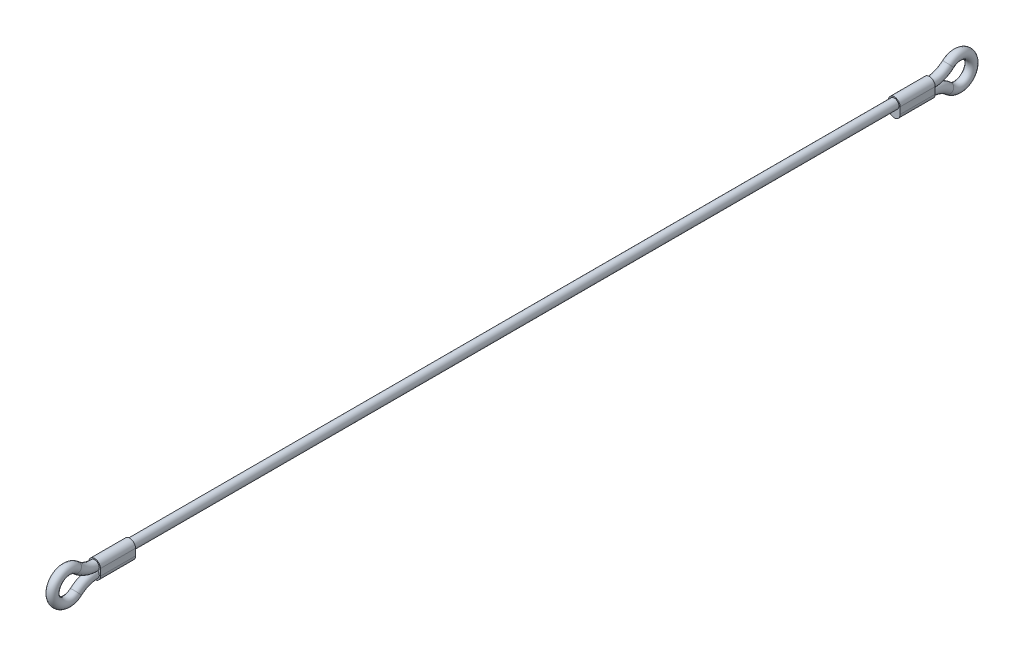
ISO-10303-21;
HEADER;
FILE_DESCRIPTION(('STEP AP214'),'2;1');
FILE_NAME('part.step','',(''),(''),'','','');
FILE_SCHEMA(('AUTOMOTIVE_DESIGN { 1 0 10303 214 1 1 1 1 }'));
ENDSEC;
DATA;
#1=APPLICATION_CONTEXT('core data for automotive mechanical design processes');
#2=APPLICATION_PROTOCOL_DEFINITION('international standard','automotive_design',2000,#1);
#3=PRODUCT_CONTEXT('',#1,'mechanical');
#4=PRODUCT('Part','Part','',(#3));
#5=PRODUCT_RELATED_PRODUCT_CATEGORY('part','',(#4));
#6=PRODUCT_DEFINITION_FORMATION('','',#4);
#7=PRODUCT_DEFINITION_CONTEXT('part definition',#1,'design');
#8=PRODUCT_DEFINITION('design','',#6,#7);
#9=PRODUCT_DEFINITION_SHAPE('','',#8);
#10=(LENGTH_UNIT() NAMED_UNIT(*) SI_UNIT(.MILLI.,.METRE.));
#11=(NAMED_UNIT(*) PLANE_ANGLE_UNIT() SI_UNIT($,.RADIAN.));
#12=(NAMED_UNIT(*) SI_UNIT($,.STERADIAN.) SOLID_ANGLE_UNIT());
#13=UNCERTAINTY_MEASURE_WITH_UNIT(LENGTH_MEASURE(1.E-05),#10,'distance_accuracy_value','');
#14=(GEOMETRIC_REPRESENTATION_CONTEXT(3) GLOBAL_UNCERTAINTY_ASSIGNED_CONTEXT((#13)) GLOBAL_UNIT_ASSIGNED_CONTEXT((#10,
#11,#12)) REPRESENTATION_CONTEXT('',''));
#15=CARTESIAN_POINT('',(0.,0.,0.));
#16=DIRECTION('',(0.,0.,1.));
#17=DIRECTION('',(1.,0.,0.));
#18=AXIS2_PLACEMENT_3D('',#15,#16,#17);
#19=CARTESIAN_POINT('',(0.,0.,-142.8));
#20=DIRECTION('',(0.,0.,1.));
#21=DIRECTION('',(1.,0.,0.));
#22=AXIS2_PLACEMENT_3D('',#19,#20,#21);
#23=CYLINDRICAL_SURFACE('',#22,1.59);
#24=CARTESIAN_POINT('',(0.,0.,-130.8));
#25=DIRECTION('',(0.,0.,1.));
#26=DIRECTION('',(0.,-1.,0.));
#27=AXIS2_PLACEMENT_3D('',#24,#25,#26);
#28=CIRCLE('',#27,1.59);
#29=CARTESIAN_POINT('',(0.,-1.59,-130.8));
#30=VERTEX_POINT('',#29);
#31=EDGE_CURVE('E11',#30,#30,#28,.F.);
#32=ORIENTED_EDGE('',*,*,#31,.F.);
#33=EDGE_LOOP('',(#32));
#34=FACE_BOUND('',#33,.T.);
#35=CARTESIAN_POINT('',(0.,0.,130.8));
#36=DIRECTION('',(0.,0.,-1.));
#37=DIRECTION('',(0.,1.,0.));
#38=AXIS2_PLACEMENT_3D('',#35,#36,#37);
#39=CIRCLE('',#38,1.59);
#40=CARTESIAN_POINT('',(0.,1.59,130.8));
#41=VERTEX_POINT('',#40);
#42=EDGE_CURVE('E44',#41,#41,#39,.F.);
#43=ORIENTED_EDGE('',*,*,#42,.F.);
#44=EDGE_LOOP('',(#43));
#45=FACE_BOUND('',#44,.T.);
#46=ADVANCED_FACE('F35',(#34,#45),#23,.T.);
#47=CARTESIAN_POINT('',(0.,0.,130.8));
#48=DIRECTION('',(0.,0.,1.));
#49=DIRECTION('',(0.,-1.,0.));
#50=AXIS2_PLACEMENT_3D('',#47,#48,#49);
#51=CYLINDRICAL_SURFACE('',#50,1.995);
#52=CARTESIAN_POINT('',(0.,0.,142.8));
#53=DIRECTION('',(0.,0.,-1.));
#54=DIRECTION('',(0.,1.,0.));
#55=AXIS2_PLACEMENT_3D('',#52,#53,#54);
#56=CIRCLE('',#55,1.995);
#57=CARTESIAN_POINT('',(-1.995,0.,142.8));
#58=VERTEX_POINT('',#57);
#59=CARTESIAN_POINT('',(1.995,0.,142.8));
#60=VERTEX_POINT('',#59);
#61=EDGE_CURVE('E126',#58,#60,#56,.T.);
#62=ORIENTED_EDGE('',*,*,#61,.T.);
#63=DIRECTION('',(0.,0.,1.));
#64=VECTOR('',#63,1.);
#65=CARTESIAN_POINT('',(1.995,0.,130.8));
#66=LINE('',#65,#64);
#67=CARTESIAN_POINT('',(1.995,0.,130.8));
#68=VERTEX_POINT('',#67);
#69=EDGE_CURVE('E184',#68,#60,#66,.T.);
#70=ORIENTED_EDGE('',*,*,#69,.F.);
#71=CARTESIAN_POINT('',(0.,0.,130.8));
#72=DIRECTION('',(0.,0.,-1.));
#73=DIRECTION('',(0.,1.,0.));
#74=AXIS2_PLACEMENT_3D('',#71,#72,#73);
#75=CIRCLE('',#74,1.995);
#76=CARTESIAN_POINT('',(-1.995,0.,130.8));
#77=VERTEX_POINT('',#76);
#78=EDGE_CURVE('E158',#77,#68,#75,.T.);
#79=ORIENTED_EDGE('',*,*,#78,.F.);
#80=DIRECTION('',(0.,0.,1.));
#81=VECTOR('',#80,1.);
#82=CARTESIAN_POINT('',(-1.995,0.,130.8));
#83=LINE('',#82,#81);
#84=EDGE_CURVE('E168',#77,#58,#83,.T.);
#85=ORIENTED_EDGE('',*,*,#84,.T.);
#86=EDGE_LOOP('',(#62,#70,#79,#85));
#87=FACE_BOUND('',#86,.T.);
#88=ADVANCED_FACE('F238',(#87),#51,.T.);
#89=CARTESIAN_POINT('',(1.995,0.,130.8));
#90=DIRECTION('',(-1.,0.,0.));
#91=DIRECTION('',(0.,0.,1.));
#92=AXIS2_PLACEMENT_3D('',#89,#90,#91);
#93=PLANE('',#92);
#94=DIRECTION('',(0.,-1.,0.));
#95=VECTOR('',#94,1.);
#96=CARTESIAN_POINT('',(1.995,0.,142.8));
#97=LINE('',#96,#95);
#98=CARTESIAN_POINT('',(1.995,-2.26625258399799,142.8));
#99=VERTEX_POINT('',#98);
#100=EDGE_CURVE('E171',#60,#99,#97,.T.);
#101=ORIENTED_EDGE('',*,*,#100,.T.);
#102=DIRECTION('',(0.,0.,1.));
#103=VECTOR('',#102,1.);
#104=CARTESIAN_POINT('',(1.995,-2.266252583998,130.8));
#105=LINE('',#104,#103);
#106=CARTESIAN_POINT('',(1.995,-2.266252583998,130.8));
#107=VERTEX_POINT('',#106);
#108=EDGE_CURVE('E181',#107,#99,#105,.T.);
#109=ORIENTED_EDGE('',*,*,#108,.F.);
#110=DIRECTION('',(0.,-1.,0.));
#111=VECTOR('',#110,1.);
#112=CARTESIAN_POINT('',(1.995,0.,130.8));
#113=LINE('',#112,#111);
#114=EDGE_CURVE('E161',#68,#107,#113,.T.);
#115=ORIENTED_EDGE('',*,*,#114,.F.);
#116=ORIENTED_EDGE('',*,*,#69,.T.);
#117=EDGE_LOOP('',(#101,#109,#115,#116));
#118=FACE_BOUND('',#117,.T.);
#119=ADVANCED_FACE('F243',(#118),#93,.F.);
#120=CARTESIAN_POINT('',(0.,-2.266252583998,130.8));
#121=DIRECTION('',(0.,0.,1.));
#122=DIRECTION('',(0.,-1.,0.));
#123=AXIS2_PLACEMENT_3D('',#120,#121,#122);
#124=CYLINDRICAL_SURFACE('',#123,1.995);
#125=CARTESIAN_POINT('',(0.,-2.26625258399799,142.8));
#126=DIRECTION('',(0.,0.,-1.));
#127=DIRECTION('',(0.,1.,0.));
#128=AXIS2_PLACEMENT_3D('',#125,#126,#127);
#129=CIRCLE('',#128,1.995);
#130=CARTESIAN_POINT('',(-1.995,-2.26625258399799,142.8));
#131=VERTEX_POINT('',#130);
#132=EDGE_CURVE('E173',#99,#131,#129,.T.);
#133=ORIENTED_EDGE('',*,*,#132,.T.);
#134=DIRECTION('',(0.,0.,1.));
#135=VECTOR('',#134,1.);
#136=CARTESIAN_POINT('',(-1.995,-2.266252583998,130.8));
#137=LINE('',#136,#135);
#138=CARTESIAN_POINT('',(-1.995,-2.266252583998,130.8));
#139=VERTEX_POINT('',#138);
#140=EDGE_CURVE('E178',#139,#131,#137,.T.);
#141=ORIENTED_EDGE('',*,*,#140,.F.);
#142=CARTESIAN_POINT('',(0.,-2.266252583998,130.8));
#143=DIRECTION('',(0.,0.,-1.));
#144=DIRECTION('',(0.,1.,0.));
#145=AXIS2_PLACEMENT_3D('',#142,#143,#144);
#146=CIRCLE('',#145,1.995);
#147=EDGE_CURVE('E164',#107,#139,#146,.T.);
#148=ORIENTED_EDGE('',*,*,#147,.F.);
#149=ORIENTED_EDGE('',*,*,#108,.T.);
#150=EDGE_LOOP('',(#133,#141,#148,#149));
#151=FACE_BOUND('',#150,.T.);
#152=ADVANCED_FACE('F282',(#151),#124,.T.);
#153=CARTESIAN_POINT('',(-1.995,0.,130.8));
#154=DIRECTION('',(1.,0.,0.));
#155=DIRECTION('',(0.,1.,0.));
#156=AXIS2_PLACEMENT_3D('',#153,#154,#155);
#157=PLANE('',#156);
#158=DIRECTION('',(0.,1.,0.));
#159=VECTOR('',#158,1.);
#160=CARTESIAN_POINT('',(-1.995,0.,142.8));
#161=LINE('',#160,#159);
#162=EDGE_CURVE('E162',#131,#58,#161,.T.);
#163=ORIENTED_EDGE('',*,*,#162,.T.);
#164=ORIENTED_EDGE('',*,*,#84,.F.);
#165=DIRECTION('',(0.,1.,0.));
#166=VECTOR('',#165,1.);
#167=CARTESIAN_POINT('',(-1.995,0.,130.8));
#168=LINE('',#167,#166);
#169=EDGE_CURVE('E166',#139,#77,#168,.T.);
#170=ORIENTED_EDGE('',*,*,#169,.F.);
#171=ORIENTED_EDGE('',*,*,#140,.T.);
#172=EDGE_LOOP('',(#163,#164,#170,#171));
#173=FACE_BOUND('',#172,.T.);
#174=ADVANCED_FACE('F278',(#173),#157,.F.);
#175=CARTESIAN_POINT('',(0.,0.,130.8));
#176=DIRECTION('',(0.,0.,-1.));
#177=DIRECTION('',(0.,1.,0.));
#178=AXIS2_PLACEMENT_3D('',#175,#176,#177);
#179=PLANE('',#178);
#180=ORIENTED_EDGE('',*,*,#42,.T.);
#181=EDGE_LOOP('',(#180));
#182=FACE_BOUND('',#181,.T.);
#183=ORIENTED_EDGE('',*,*,#78,.T.);
#184=ORIENTED_EDGE('',*,*,#114,.T.);
#185=ORIENTED_EDGE('',*,*,#147,.T.);
#186=ORIENTED_EDGE('',*,*,#169,.T.);
#187=EDGE_LOOP('',(#183,#184,#185,#186));
#188=FACE_BOUND('',#187,.T.);
#189=ADVANCED_FACE('F232',(#182,#188),#179,.T.);
#190=CARTESIAN_POINT('',(0.,0.,142.8));
#191=DIRECTION('',(0.,0.,-1.));
#192=DIRECTION('',(0.,1.,0.));
#193=AXIS2_PLACEMENT_3D('',#190,#191,#192);
#194=PLANE('',#193);
#195=CARTESIAN_POINT('',(0.,0.,142.8));
#196=DIRECTION('',(0.,0.,1.));
#197=DIRECTION('',(1.,0.,0.));
#198=AXIS2_PLACEMENT_3D('',#195,#196,#197);
#199=CIRCLE('',#198,1.59);
#200=CARTESIAN_POINT('',(1.11540342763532,-1.13312629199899,142.8));
#201=VERTEX_POINT('',#200);
#202=CARTESIAN_POINT('',(-1.11540342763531,-1.13312629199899,142.8));
#203=VERTEX_POINT('',#202);
#204=EDGE_CURVE('E196',#201,#203,#199,.T.);
#205=ORIENTED_EDGE('',*,*,#204,.F.);
#206=CARTESIAN_POINT('',(0.,-2.26625258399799,142.8));
#207=DIRECTION('',(0.,0.,-1.));
#208=DIRECTION('',(1.,0.,0.));
#209=AXIS2_PLACEMENT_3D('',#206,#207,#208);
#210=CIRCLE('',#209,1.59);
#211=EDGE_CURVE('E57',#201,#203,#210,.T.);
#212=ORIENTED_EDGE('',*,*,#211,.T.);
#213=EDGE_LOOP('',(#205,#212));
#214=FACE_BOUND('',#213,.T.);
#215=ORIENTED_EDGE('',*,*,#61,.F.);
#216=ORIENTED_EDGE('',*,*,#162,.F.);
#217=ORIENTED_EDGE('',*,*,#132,.F.);
#218=ORIENTED_EDGE('',*,*,#100,.F.);
#219=EDGE_LOOP('',(#215,#216,#217,#218));
#220=FACE_BOUND('',#219,.T.);
#221=ADVANCED_FACE('F226',(#214,#220),#194,.F.);
#222=CARTESIAN_POINT('',(0.,-1.13312629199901,152.4));
#223=DIRECTION('',(1.,0.,0.));
#224=DIRECTION('',(0.,0.,-1.));
#225=AXIS2_PLACEMENT_3D('',#222,#223,#224);
#226=TOROIDAL_SURFACE('',#225,4.80000000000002,1.59);
#227=CARTESIAN_POINT('',(0.,2.4445824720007,149.2));
#228=DIRECTION('',(0.,0.666666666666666,0.745355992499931));
#229=DIRECTION('',(1.,0.,0.));
#230=AXIS2_PLACEMENT_3D('',#227,#228,#229);
#231=CIRCLE('',#230,1.59);
#232=CARTESIAN_POINT('',(0.,3.6296985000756,148.14));
#233=VERTEX_POINT('',#232);
#234=EDGE_CURVE('E198',#233,#233,#231,.T.);
#235=CARTESIAN_POINT('',(0.,-4.71083505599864,149.2));
#236=DIRECTION('',(0.,0.666666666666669,-0.745355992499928));
#237=DIRECTION('',(1.,0.,0.));
#238=AXIS2_PLACEMENT_3D('',#235,#236,#237);
#239=CIRCLE('',#238,1.59);
#240=CARTESIAN_POINT('',(0.,-5.89595108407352,148.14));
#241=VERTEX_POINT('',#240);
#242=EDGE_CURVE('E201',#241,#241,#239,.T.);
#243=CARTESIAN_POINT('',(0.,-1.13312629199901,152.4));
#244=DIRECTION('',(1.,0.,0.));
#245=DIRECTION('',(0.,0.,-1.));
#246=AXIS2_PLACEMENT_3D('',#243,#244,#245);
#247=CIRCLE('',#246,6.39000000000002);
#248=EDGE_CURVE('',#233,#241,#247,.T.);
#249=ORIENTED_EDGE('',*,*,#234,.T.);
#250=ORIENTED_EDGE('',*,*,#242,.F.);
#251=ORIENTED_EDGE('',*,*,#248,.T.);
#252=ORIENTED_EDGE('',*,*,#248,.F.);
#253=EDGE_LOOP('',(#249,#251,#250,#252));
#254=FACE_BOUND('',#253,.T.);
#255=ADVANCED_FACE('F224',(#254),#226,.T.);
#256=CARTESIAN_POINT('',(0.,-11.866252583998,142.8));
#257=DIRECTION('',(-1.,0.,0.));
#258=DIRECTION('',(0.,0.,1.));
#259=AXIS2_PLACEMENT_3D('',#256,#257,#258);
#260=TOROIDAL_SURFACE('',#259,9.59999999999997,1.59);
#261=CARTESIAN_POINT('',(-1.11540342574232,-1.13312629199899,142.7998));
#262=CARTESIAN_POINT('',(-1.11534851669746,-1.13312629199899,142.92773673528));
#263=CARTESIAN_POINT('',(-1.11308141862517,-1.13312629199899,143.055686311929));
#264=CARTESIAN_POINT('',(-1.10371453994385,-1.13312629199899,143.31155828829));
#265=CARTESIAN_POINT('',(-1.09660901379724,-1.13312629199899,143.43948047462));
#266=CARTESIAN_POINT('',(-1.07704253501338,-1.13312629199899,143.696418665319));
#267=CARTESIAN_POINT('',(-1.06452051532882,-1.13312629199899,143.825430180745));
#268=CARTESIAN_POINT('',(-1.03319430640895,-1.133126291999,144.082627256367));
#269=CARTESIAN_POINT('',(-1.01439338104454,-1.133126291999,144.210813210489));
#270=CARTESIAN_POINT('',(-0.966908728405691,-1.13312629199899,144.478005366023));
#271=CARTESIAN_POINT('',(-0.93745613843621,-1.13312629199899,144.616883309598));
#272=CARTESIAN_POINT('',(-0.883915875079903,-1.13312629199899,144.82263125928));
#273=CARTESIAN_POINT('',(-0.864530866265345,-1.133126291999,144.890724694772));
#274=CARTESIAN_POINT('',(-0.821996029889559,-1.133126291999,145.025715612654));
#275=CARTESIAN_POINT('',(-0.798847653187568,-1.133126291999,145.092613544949));
#276=CARTESIAN_POINT('',(-0.744519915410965,-1.133126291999,145.233542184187));
#277=CARTESIAN_POINT('',(-0.712679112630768,-1.133126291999,145.307321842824));
#278=CARTESIAN_POINT('',(-0.641279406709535,-1.133126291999,145.451146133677));
#279=CARTESIAN_POINT('',(-0.60172727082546,-1.133126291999,145.521193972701));
#280=CARTESIAN_POINT('',(-0.528948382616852,-1.133126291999,145.62943568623));
#281=CARTESIAN_POINT('',(-0.498892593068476,-1.133126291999,145.669741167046));
#282=CARTESIAN_POINT('',(-0.433770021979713,-1.133126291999,145.7461405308));
#283=CARTESIAN_POINT('',(-0.398710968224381,-1.133126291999,145.782240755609));
#284=CARTESIAN_POINT('',(-0.335060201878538,-1.133126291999,145.837058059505));
#285=CARTESIAN_POINT('',(-0.308066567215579,-1.133126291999,145.857612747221));
#286=CARTESIAN_POINT('',(-0.251279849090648,-1.133126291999,145.894433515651));
#287=CARTESIAN_POINT('',(-0.221491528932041,-1.133126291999,145.910706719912));
#288=CARTESIAN_POINT('',(-0.165682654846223,-1.133126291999,145.934797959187));
#289=CARTESIAN_POINT('',(-0.140117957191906,-1.133126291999,145.943660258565));
#290=CARTESIAN_POINT('',(-0.0878641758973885,-1.133126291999,145.956990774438));
#291=CARTESIAN_POINT('',(-0.0611762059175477,-1.133126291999,145.961463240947));
#292=CARTESIAN_POINT('',(-0.00731772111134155,-1.133126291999,145.965572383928));
#293=CARTESIAN_POINT('',(0.0198542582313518,-1.133126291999,145.965190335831));
#294=CARTESIAN_POINT('',(0.0736951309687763,-1.133126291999,145.959586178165));
#295=CARTESIAN_POINT('',(0.100363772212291,-1.13312629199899,145.954361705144));
#296=CARTESIAN_POINT('',(0.151195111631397,-1.133126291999,145.939957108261));
#297=CARTESIAN_POINT('',(0.175416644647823,-1.133126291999,145.930979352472));
#298=CARTESIAN_POINT('',(0.222373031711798,-1.133126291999,145.909774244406));
#299=CARTESIAN_POINT('',(0.245107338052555,-1.133126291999,145.897545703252));
#300=CARTESIAN_POINT('',(0.304759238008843,-1.133126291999,145.860748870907));
#301=CARTESIAN_POINT('',(0.340101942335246,-1.133126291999,145.833635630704));
#302=CARTESIAN_POINT('',(0.406281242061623,-1.133126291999,145.77436880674));
#303=CARTESIAN_POINT('',(0.437102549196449,-1.133126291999,145.742198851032));
#304=CARTESIAN_POINT('',(0.492718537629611,-1.133126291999,145.67701365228));
#305=CARTESIAN_POINT('',(0.517788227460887,-1.133126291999,145.644229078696));
#306=CARTESIAN_POINT('',(0.565060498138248,-1.133126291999,145.576639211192));
#307=CARTESIAN_POINT('',(0.587260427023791,-1.133126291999,145.541832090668));
#308=CARTESIAN_POINT('',(0.650275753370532,-1.13312629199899,145.435150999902));
#309=CARTESIAN_POINT('',(0.687428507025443,-1.133126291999,145.361116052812));
#310=CARTESIAN_POINT('',(0.745434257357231,-1.133126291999,145.230275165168));
#311=CARTESIAN_POINT('',(0.767985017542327,-1.13312629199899,145.174182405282));
#312=CARTESIAN_POINT('',(0.809859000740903,-1.13312629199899,145.060796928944));
#313=CARTESIAN_POINT('',(0.82918188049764,-1.133126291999,145.003504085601));
#314=CARTESIAN_POINT('',(0.883166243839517,-1.133126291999,144.830173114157));
#315=CARTESIAN_POINT('',(0.91376333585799,-1.13312629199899,144.712874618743));
#316=CARTESIAN_POINT('',(0.967023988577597,-1.13312629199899,144.475955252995));
#317=CARTESIAN_POINT('',(0.989647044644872,-1.13312629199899,144.356325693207));
#318=CARTESIAN_POINT('',(1.02845868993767,-1.13312629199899,144.116012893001));
#319=CARTESIAN_POINT('',(1.04464572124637,-1.13312629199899,143.995329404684));
#320=CARTESIAN_POINT('',(1.06818793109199,-1.13312629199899,143.78453669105));
#321=CARTESIAN_POINT('',(1.07674400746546,-1.13312629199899,143.694556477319));
#322=CARTESIAN_POINT('',(1.09119671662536,-1.13312629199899,143.514367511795));
#323=CARTESIAN_POINT('',(1.09709289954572,-1.13312629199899,143.424158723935));
#324=CARTESIAN_POINT('',(1.10635885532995,-1.13312629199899,143.244939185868));
#325=CARTESIAN_POINT('',(1.10976438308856,-1.13312629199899,143.155930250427));
#326=CARTESIAN_POINT('',(1.11428069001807,-1.13312629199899,142.977880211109));
#327=CARTESIAN_POINT('',(1.11539214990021,-1.13312629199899,142.888839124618));
#328=CARTESIAN_POINT('',(1.11540342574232,-1.13312629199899,142.7998));
#329=B_SPLINE_CURVE_WITH_KNOTS('',3,(#261,#262,#263,#264,#265,#266,#267,#268,#269,#270,#271,
#272,#273,#274,#275,#276,#277,#278,#279,#280,#281,#282,#283,#284,#285,#286,#287,#288,#289,#290,
#291,#292,#293,#294,#295,#296,#297,#298,#299,#300,#301,#302,#303,#304,#305,#306,#307,#308,#309,
#310,#311,#312,#313,#314,#315,#316,#317,#318,#319,#320,#321,#322,#323,#324,#325,#326,#327,#328),
.UNSPECIFIED.,.F.,.F.,(4,2,2,2,2,2,2,2,2,2,2,2,2,2,2,2,2,2,2,2,2,2,2,2,2,2,2,2,2,2,2,2,2,4),(0.,
0.383810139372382,0.768076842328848,1.15679365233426,1.5453087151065,1.97071269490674,
2.18302701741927,2.39525968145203,2.63604166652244,2.8766132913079,3.02716706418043,
3.17749076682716,3.27898827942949,3.38031583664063,3.46115731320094,3.5419204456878,
3.62299518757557,3.7041095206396,3.78132200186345,3.858562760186,3.99142265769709,
4.1247219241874,4.24834991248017,4.37209134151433,4.61994843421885,4.80123584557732,
4.98254252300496,5.34577733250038,5.71083149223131,6.07597396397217,6.34709439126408,
6.61826065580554,6.88545336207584,7.15256677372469),.UNSPECIFIED.);
#330=EDGE_CURVE('E205',#203,#201,#329,.T.);
#331=ORIENTED_EDGE('',*,*,#330,.F.);
#332=ORIENTED_EDGE('',*,*,#211,.F.);
#333=EDGE_LOOP('',(#331,#332));
#334=FACE_BOUND('',#333,.T.);
#335=ORIENTED_EDGE('',*,*,#242,.T.);
#336=EDGE_LOOP('',(#335));
#337=FACE_BOUND('',#336,.T.);
#338=ADVANCED_FACE('F37',(#334,#337),#260,.T.);
#339=CARTESIAN_POINT('',(0.,9.59999999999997,142.8));
#340=DIRECTION('',(-1.,0.,0.));
#341=DIRECTION('',(0.,0.,1.));
#342=AXIS2_PLACEMENT_3D('',#339,#340,#341);
#343=TOROIDAL_SURFACE('',#342,9.59999999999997,1.59);
#344=ORIENTED_EDGE('',*,*,#234,.F.);
#345=EDGE_LOOP('',(#344));
#346=FACE_BOUND('',#345,.T.);
#347=ORIENTED_EDGE('',*,*,#204,.T.);
#348=ORIENTED_EDGE('',*,*,#330,.T.);
#349=EDGE_LOOP('',(#347,#348));
#350=FACE_BOUND('',#349,.T.);
#351=ADVANCED_FACE('F219',(#346,#350),#343,.T.);
#352=CARTESIAN_POINT('',(0.,0.,-130.8));
#353=DIRECTION('',(0.,0.,-1.));
#354=DIRECTION('',(0.,1.,0.));
#355=AXIS2_PLACEMENT_3D('',#352,#353,#354);
#356=CYLINDRICAL_SURFACE('',#355,1.995);
#357=CARTESIAN_POINT('',(0.,0.,-142.8));
#358=DIRECTION('',(0.,0.,-1.));
#359=DIRECTION('',(0.,1.,0.));
#360=AXIS2_PLACEMENT_3D('',#357,#358,#359);
#361=CIRCLE('',#360,1.995);
#362=CARTESIAN_POINT('',(-1.995,0.,-142.8));
#363=VERTEX_POINT('',#362);
#364=CARTESIAN_POINT('',(1.995,0.,-142.8));
#365=VERTEX_POINT('',#364);
#366=EDGE_CURVE('E121',#363,#365,#361,.T.);
#367=ORIENTED_EDGE('',*,*,#366,.F.);
#368=DIRECTION('',(0.,0.,-1.));
#369=VECTOR('',#368,1.);
#370=CARTESIAN_POINT('',(-1.995,0.,-130.8));
#371=LINE('',#370,#369);
#372=CARTESIAN_POINT('',(-1.995,0.,-130.8));
#373=VERTEX_POINT('',#372);
#374=EDGE_CURVE('E115',#373,#363,#371,.T.);
#375=ORIENTED_EDGE('',*,*,#374,.F.);
#376=CARTESIAN_POINT('',(0.,0.,-130.8));
#377=DIRECTION('',(0.,0.,-1.));
#378=DIRECTION('',(0.,1.,0.));
#379=AXIS2_PLACEMENT_3D('',#376,#377,#378);
#380=CIRCLE('',#379,1.995);
#381=CARTESIAN_POINT('',(1.995,0.,-130.8));
#382=VERTEX_POINT('',#381);
#383=EDGE_CURVE('E118',#373,#382,#380,.T.);
#384=ORIENTED_EDGE('',*,*,#383,.T.);
#385=DIRECTION('',(0.,0.,-1.));
#386=VECTOR('',#385,1.);
#387=CARTESIAN_POINT('',(1.995,0.,-130.8));
#388=LINE('',#387,#386);
#389=EDGE_CURVE('E145',#382,#365,#388,.T.);
#390=ORIENTED_EDGE('',*,*,#389,.T.);
#391=EDGE_LOOP('',(#367,#375,#384,#390));
#392=FACE_BOUND('',#391,.T.);
#393=ADVANCED_FACE('F117',(#392),#356,.T.);
#394=CARTESIAN_POINT('',(-1.995,0.,-130.8));
#395=DIRECTION('',(-1.,0.,0.));
#396=DIRECTION('',(0.,-1.,0.));
#397=AXIS2_PLACEMENT_3D('',#394,#395,#396);
#398=PLANE('',#397);
#399=DIRECTION('',(0.,1.,0.));
#400=VECTOR('',#399,1.);
#401=CARTESIAN_POINT('',(-1.995,0.,-142.8));
#402=LINE('',#401,#400);
#403=CARTESIAN_POINT('',(-1.995,-2.26625258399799,-142.8));
#404=VERTEX_POINT('',#403);
#405=EDGE_CURVE('E147',#404,#363,#402,.T.);
#406=ORIENTED_EDGE('',*,*,#405,.F.);
#407=DIRECTION('',(0.,0.,-1.));
#408=VECTOR('',#407,1.);
#409=CARTESIAN_POINT('',(-1.995,-2.266252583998,-130.8));
#410=LINE('',#409,#408);
#411=CARTESIAN_POINT('',(-1.995,-2.266252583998,-130.8));
#412=VERTEX_POINT('',#411);
#413=EDGE_CURVE('E127',#412,#404,#410,.T.);
#414=ORIENTED_EDGE('',*,*,#413,.F.);
#415=DIRECTION('',(0.,1.,0.));
#416=VECTOR('',#415,1.);
#417=CARTESIAN_POINT('',(-1.995,0.,-130.8));
#418=LINE('',#417,#416);
#419=EDGE_CURVE('E133',#412,#373,#418,.T.);
#420=ORIENTED_EDGE('',*,*,#419,.T.);
#421=ORIENTED_EDGE('',*,*,#374,.T.);
#422=EDGE_LOOP('',(#406,#414,#420,#421));
#423=FACE_BOUND('',#422,.T.);
#424=ADVANCED_FACE('F139',(#423),#398,.T.);
#425=CARTESIAN_POINT('',(0.,-2.266252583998,-130.8));
#426=DIRECTION('',(0.,0.,-1.));
#427=DIRECTION('',(0.,1.,0.));
#428=AXIS2_PLACEMENT_3D('',#425,#426,#427);
#429=CYLINDRICAL_SURFACE('',#428,1.995);
#430=CARTESIAN_POINT('',(0.,-2.26625258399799,-142.8));
#431=DIRECTION('',(0.,0.,-1.));
#432=DIRECTION('',(0.,1.,0.));
#433=AXIS2_PLACEMENT_3D('',#430,#431,#432);
#434=CIRCLE('',#433,1.995);
#435=CARTESIAN_POINT('',(1.995,-2.26625258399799,-142.8));
#436=VERTEX_POINT('',#435);
#437=EDGE_CURVE('E149',#436,#404,#434,.T.);
#438=ORIENTED_EDGE('',*,*,#437,.F.);
#439=DIRECTION('',(0.,0.,-1.));
#440=VECTOR('',#439,1.);
#441=CARTESIAN_POINT('',(1.995,-2.266252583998,-130.8));
#442=LINE('',#441,#440);
#443=CARTESIAN_POINT('',(1.995,-2.266252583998,-130.8));
#444=VERTEX_POINT('',#443);
#445=EDGE_CURVE('E155',#444,#436,#442,.T.);
#446=ORIENTED_EDGE('',*,*,#445,.F.);
#447=CARTESIAN_POINT('',(0.,-2.266252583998,-130.8));
#448=DIRECTION('',(0.,0.,-1.));
#449=DIRECTION('',(0.,1.,0.));
#450=AXIS2_PLACEMENT_3D('',#447,#448,#449);
#451=CIRCLE('',#450,1.995);
#452=EDGE_CURVE('E140',#444,#412,#451,.T.);
#453=ORIENTED_EDGE('',*,*,#452,.T.);
#454=ORIENTED_EDGE('',*,*,#413,.T.);
#455=EDGE_LOOP('',(#438,#446,#453,#454));
#456=FACE_BOUND('',#455,.T.);
#457=ADVANCED_FACE('F265',(#456),#429,.T.);
#458=CARTESIAN_POINT('',(1.995,0.,-130.8));
#459=DIRECTION('',(1.,0.,0.));
#460=DIRECTION('',(0.,0.,-1.));
#461=AXIS2_PLACEMENT_3D('',#458,#459,#460);
#462=PLANE('',#461);
#463=DIRECTION('',(0.,-1.,0.));
#464=VECTOR('',#463,1.);
#465=CARTESIAN_POINT('',(1.995,0.,-142.8));
#466=LINE('',#465,#464);
#467=EDGE_CURVE('E137',#365,#436,#466,.T.);
#468=ORIENTED_EDGE('',*,*,#467,.F.);
#469=ORIENTED_EDGE('',*,*,#389,.F.);
#470=DIRECTION('',(0.,-1.,0.));
#471=VECTOR('',#470,1.);
#472=CARTESIAN_POINT('',(1.995,0.,-130.8));
#473=LINE('',#472,#471);
#474=EDGE_CURVE('E136',#382,#444,#473,.T.);
#475=ORIENTED_EDGE('',*,*,#474,.T.);
#476=ORIENTED_EDGE('',*,*,#445,.T.);
#477=EDGE_LOOP('',(#468,#469,#475,#476));
#478=FACE_BOUND('',#477,.T.);
#479=ADVANCED_FACE('F262',(#478),#462,.T.);
#480=CARTESIAN_POINT('',(0.,0.,-130.8));
#481=DIRECTION('',(0.,0.,1.));
#482=DIRECTION('',(0.,1.,0.));
#483=AXIS2_PLACEMENT_3D('',#480,#481,#482);
#484=PLANE('',#483);
#485=ORIENTED_EDGE('',*,*,#31,.T.);
#486=EDGE_LOOP('',(#485));
#487=FACE_BOUND('',#486,.T.);
#488=ORIENTED_EDGE('',*,*,#383,.F.);
#489=ORIENTED_EDGE('',*,*,#419,.F.);
#490=ORIENTED_EDGE('',*,*,#452,.F.);
#491=ORIENTED_EDGE('',*,*,#474,.F.);
#492=EDGE_LOOP('',(#488,#489,#490,#491));
#493=FACE_BOUND('',#492,.T.);
#494=ADVANCED_FACE('F131',(#487,#493),#484,.T.);
#495=CARTESIAN_POINT('',(0.,0.,-142.8));
#496=DIRECTION('',(0.,0.,1.));
#497=DIRECTION('',(0.,1.,0.));
#498=AXIS2_PLACEMENT_3D('',#495,#496,#497);
#499=PLANE('',#498);
#500=CARTESIAN_POINT('',(0.,-2.26625258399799,-142.8));
#501=DIRECTION('',(0.,0.,-1.));
#502=DIRECTION('',(1.,0.,0.));
#503=AXIS2_PLACEMENT_3D('',#500,#501,#502);
#504=CIRCLE('',#503,1.59);
#505=CARTESIAN_POINT('',(1.11540342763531,-1.133126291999,-142.8));
#506=VERTEX_POINT('',#505);
#507=CARTESIAN_POINT('',(-1.11540342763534,-1.13312629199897,-142.8));
#508=VERTEX_POINT('',#507);
#509=EDGE_CURVE('E187',#506,#508,#504,.T.);
#510=ORIENTED_EDGE('',*,*,#509,.F.);
#511=CARTESIAN_POINT('',(0.,0.,-142.8));
#512=DIRECTION('',(0.,0.,1.));
#513=DIRECTION('',(1.,0.,0.));
#514=AXIS2_PLACEMENT_3D('',#511,#512,#513);
#515=CIRCLE('',#514,1.59);
#516=EDGE_CURVE('E50',#506,#508,#515,.T.);
#517=ORIENTED_EDGE('',*,*,#516,.T.);
#518=EDGE_LOOP('',(#510,#517));
#519=FACE_BOUND('',#518,.T.);
#520=ORIENTED_EDGE('',*,*,#366,.T.);
#521=ORIENTED_EDGE('',*,*,#467,.T.);
#522=ORIENTED_EDGE('',*,*,#437,.T.);
#523=ORIENTED_EDGE('',*,*,#405,.T.);
#524=EDGE_LOOP('',(#520,#521,#522,#523));
#525=FACE_BOUND('',#524,.T.);
#526=ADVANCED_FACE('F255',(#519,#525),#499,.F.);
#527=CARTESIAN_POINT('',(0.,-1.13312629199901,-152.4));
#528=DIRECTION('',(1.,0.,0.));
#529=DIRECTION('',(0.,0.,-1.));
#530=AXIS2_PLACEMENT_3D('',#527,#528,#529);
#531=TOROIDAL_SURFACE('',#530,4.80000000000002,1.59);
#532=CARTESIAN_POINT('',(0.,-4.71083505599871,-149.2));
#533=DIRECTION('',(0.,-0.666666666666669,-0.745355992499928));
#534=DIRECTION('',(1.,0.,0.));
#535=AXIS2_PLACEMENT_3D('',#532,#533,#534);
#536=CIRCLE('',#535,1.59);
#537=CARTESIAN_POINT('',(0.,-5.89595108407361,-148.14));
#538=VERTEX_POINT('',#537);
#539=EDGE_CURVE('E189',#538,#538,#536,.T.);
#540=CARTESIAN_POINT('',(0.,2.44458247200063,-149.2));
#541=DIRECTION('',(0.,-0.666666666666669,0.745355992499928));
#542=DIRECTION('',(1.,0.,0.));
#543=AXIS2_PLACEMENT_3D('',#540,#541,#542);
#544=CIRCLE('',#543,1.59);
#545=CARTESIAN_POINT('',(0.,3.6296985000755,-148.14));
#546=VERTEX_POINT('',#545);
#547=EDGE_CURVE('E192',#546,#546,#544,.T.);
#548=CARTESIAN_POINT('',(0.,-1.13312629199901,-152.4));
#549=DIRECTION('',(1.,0.,0.));
#550=DIRECTION('',(0.,0.,-1.));
#551=AXIS2_PLACEMENT_3D('',#548,#549,#550);
#552=CIRCLE('',#551,6.39000000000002);
#553=EDGE_CURVE('',#538,#546,#552,.T.);
#554=ORIENTED_EDGE('',*,*,#539,.T.);
#555=ORIENTED_EDGE('',*,*,#547,.F.);
#556=ORIENTED_EDGE('',*,*,#553,.T.);
#557=ORIENTED_EDGE('',*,*,#553,.F.);
#558=EDGE_LOOP('',(#554,#556,#555,#557));
#559=FACE_BOUND('',#558,.T.);
#560=ADVANCED_FACE('F258',(#559),#531,.T.);
#561=CARTESIAN_POINT('',(0.,9.59999999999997,-142.8));
#562=DIRECTION('',(-1.,0.,0.));
#563=DIRECTION('',(0.,0.,1.));
#564=AXIS2_PLACEMENT_3D('',#561,#562,#563);
#565=TOROIDAL_SURFACE('',#564,9.59999999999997,1.59);
#566=CARTESIAN_POINT('',(-1.11540342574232,-1.13312629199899,-142.7998));
#567=CARTESIAN_POINT('',(-1.11534851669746,-1.13312629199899,-142.92773673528));
#568=CARTESIAN_POINT('',(-1.11308141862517,-1.13312629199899,-143.055686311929));
#569=CARTESIAN_POINT('',(-1.10371453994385,-1.13312629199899,-143.31155828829));
#570=CARTESIAN_POINT('',(-1.09660901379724,-1.13312629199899,-143.43948047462));
#571=CARTESIAN_POINT('',(-1.07704253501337,-1.13312629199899,-143.696418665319));
#572=CARTESIAN_POINT('',(-1.06452051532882,-1.13312629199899,-143.825430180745));
#573=CARTESIAN_POINT('',(-1.03319430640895,-1.133126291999,-144.082627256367));
#574=CARTESIAN_POINT('',(-1.01439338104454,-1.133126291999,-144.210813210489));
#575=CARTESIAN_POINT('',(-0.966908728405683,-1.133126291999,-144.478005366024));
#576=CARTESIAN_POINT('',(-0.9374561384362,-1.133126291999,-144.616883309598));
#577=CARTESIAN_POINT('',(-0.883915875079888,-1.133126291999,-144.82263125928));
#578=CARTESIAN_POINT('',(-0.864530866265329,-1.133126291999,-144.890724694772));
#579=CARTESIAN_POINT('',(-0.821996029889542,-1.133126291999,-145.025715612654));
#580=CARTESIAN_POINT('',(-0.798847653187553,-1.133126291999,-145.092613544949));
#581=CARTESIAN_POINT('',(-0.744519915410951,-1.133126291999,-145.233542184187));
#582=CARTESIAN_POINT('',(-0.712679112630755,-1.133126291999,-145.307321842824));
#583=CARTESIAN_POINT('',(-0.641279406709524,-1.133126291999,-145.451146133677));
#584=CARTESIAN_POINT('',(-0.601727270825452,-1.133126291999,-145.521193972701));
#585=CARTESIAN_POINT('',(-0.528948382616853,-1.133126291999,-145.62943568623));
#586=CARTESIAN_POINT('',(-0.498892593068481,-1.133126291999,-145.669741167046));
#587=CARTESIAN_POINT('',(-0.433770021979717,-1.133126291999,-145.7461405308));
#588=CARTESIAN_POINT('',(-0.398710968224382,-1.133126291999,-145.782240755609));
#589=CARTESIAN_POINT('',(-0.335060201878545,-1.133126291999,-145.837058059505));
#590=CARTESIAN_POINT('',(-0.308066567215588,-1.133126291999,-145.857612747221));
#591=CARTESIAN_POINT('',(-0.251279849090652,-1.133126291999,-145.894433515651));
#592=CARTESIAN_POINT('',(-0.221491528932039,-1.133126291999,-145.910706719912));
#593=CARTESIAN_POINT('',(-0.165682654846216,-1.133126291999,-145.934797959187));
#594=CARTESIAN_POINT('',(-0.1401179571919,-1.133126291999,-145.943660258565));
#595=CARTESIAN_POINT('',(-0.0878641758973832,-1.133126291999,-145.956990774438));
#596=CARTESIAN_POINT('',(-0.0611762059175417,-1.133126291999,-145.961463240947));
#597=CARTESIAN_POINT('',(-0.00731772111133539,-1.133126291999,-145.965572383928));
#598=CARTESIAN_POINT('',(0.0198542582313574,-1.133126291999,-145.965190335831));
#599=CARTESIAN_POINT('',(0.0736951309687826,-1.133126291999,-145.959586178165));
#600=CARTESIAN_POINT('',(0.100363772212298,-1.133126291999,-145.954361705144));
#601=CARTESIAN_POINT('',(0.15119511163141,-1.133126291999,-145.939957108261));
#602=CARTESIAN_POINT('',(0.175416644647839,-1.133126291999,-145.930979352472));
#603=CARTESIAN_POINT('',(0.222373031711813,-1.133126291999,-145.909774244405));
#604=CARTESIAN_POINT('',(0.245107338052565,-1.133126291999,-145.897545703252));
#605=CARTESIAN_POINT('',(0.30475923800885,-1.133126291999,-145.860748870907));
#606=CARTESIAN_POINT('',(0.340101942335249,-1.133126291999,-145.833635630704));
#607=CARTESIAN_POINT('',(0.406281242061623,-1.133126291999,-145.77436880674));
#608=CARTESIAN_POINT('',(0.43710254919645,-1.133126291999,-145.742198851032));
#609=CARTESIAN_POINT('',(0.492718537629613,-1.133126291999,-145.67701365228));
#610=CARTESIAN_POINT('',(0.517788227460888,-1.133126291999,-145.644229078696));
#611=CARTESIAN_POINT('',(0.565060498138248,-1.133126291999,-145.576639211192));
#612=CARTESIAN_POINT('',(0.587260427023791,-1.133126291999,-145.541832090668));
#613=CARTESIAN_POINT('',(0.650275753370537,-1.133126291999,-145.435150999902));
#614=CARTESIAN_POINT('',(0.687428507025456,-1.133126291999,-145.361116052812));
#615=CARTESIAN_POINT('',(0.745434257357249,-1.133126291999,-145.230275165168));
#616=CARTESIAN_POINT('',(0.767985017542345,-1.133126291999,-145.174182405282));
#617=CARTESIAN_POINT('',(0.809859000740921,-1.133126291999,-145.060796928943));
#618=CARTESIAN_POINT('',(0.829181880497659,-1.133126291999,-145.003504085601));
#619=CARTESIAN_POINT('',(0.883166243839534,-1.133126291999,-144.830173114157));
#620=CARTESIAN_POINT('',(0.913763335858,-1.133126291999,-144.712874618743));
#621=CARTESIAN_POINT('',(0.967023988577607,-1.133126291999,-144.475955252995));
#622=CARTESIAN_POINT('',(0.989647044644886,-1.133126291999,-144.356325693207));
#623=CARTESIAN_POINT('',(1.02845868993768,-1.133126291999,-144.116012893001));
#624=CARTESIAN_POINT('',(1.04464572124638,-1.133126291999,-143.995329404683));
#625=CARTESIAN_POINT('',(1.068187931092,-1.133126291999,-143.78453669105));
#626=CARTESIAN_POINT('',(1.07674400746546,-1.133126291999,-143.694556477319));
#627=CARTESIAN_POINT('',(1.09119671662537,-1.133126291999,-143.514367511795));
#628=CARTESIAN_POINT('',(1.09709289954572,-1.133126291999,-143.424158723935));
#629=CARTESIAN_POINT('',(1.10635885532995,-1.133126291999,-143.244939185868));
#630=CARTESIAN_POINT('',(1.10976438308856,-1.133126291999,-143.155930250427));
#631=CARTESIAN_POINT('',(1.11428069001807,-1.13312629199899,-142.977880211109));
#632=CARTESIAN_POINT('',(1.11539214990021,-1.13312629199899,-142.888839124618));
#633=CARTESIAN_POINT('',(1.11540342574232,-1.13312629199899,-142.7998));
#634=B_SPLINE_CURVE_WITH_KNOTS('',3,(#566,#567,#568,#569,#570,#571,#572,#573,#574,#575,#576,
#577,#578,#579,#580,#581,#582,#583,#584,#585,#586,#587,#588,#589,#590,#591,#592,#593,#594,#595,
#596,#597,#598,#599,#600,#601,#602,#603,#604,#605,#606,#607,#608,#609,#610,#611,#612,#613,#614,
#615,#616,#617,#618,#619,#620,#621,#622,#623,#624,#625,#626,#627,#628,#629,#630,#631,#632,#633),
.UNSPECIFIED.,.F.,.F.,(4,2,2,2,2,2,2,2,2,2,2,2,2,2,2,2,2,2,2,2,2,2,2,2,2,2,2,2,2,2,2,2,2,4),(0.,
0.383810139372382,0.76807684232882,1.1567936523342,1.54530871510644,1.97071269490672,
2.18302701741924,2.39525968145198,2.63604166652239,2.87661329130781,3.02716706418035,
3.17749076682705,3.2789882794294,3.38031583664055,3.46115731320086,3.54192044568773,
3.62299518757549,3.70410952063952,3.7813220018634,3.85856276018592,3.991422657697,
4.12472192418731,4.24834991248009,4.37209134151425,4.61994843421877,4.8012358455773,
4.98254252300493,5.34577733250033,5.71083149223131,6.07597396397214,6.34709439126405,
6.61826065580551,6.88545336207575,7.15256677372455),.UNSPECIFIED.);
#635=EDGE_CURVE('E212',#508,#506,#634,.T.);
#636=ORIENTED_EDGE('',*,*,#635,.F.);
#637=ORIENTED_EDGE('',*,*,#516,.F.);
#638=EDGE_LOOP('',(#636,#637));
#639=FACE_BOUND('',#638,.T.);
#640=ORIENTED_EDGE('',*,*,#547,.T.);
#641=EDGE_LOOP('',(#640));
#642=FACE_BOUND('',#641,.T.);
#643=ADVANCED_FACE('F292',(#639,#642),#565,.T.);
#644=CARTESIAN_POINT('',(0.,-11.866252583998,-142.8));
#645=DIRECTION('',(-1.,0.,0.));
#646=DIRECTION('',(0.,0.,1.));
#647=AXIS2_PLACEMENT_3D('',#644,#645,#646);
#648=TOROIDAL_SURFACE('',#647,9.59999999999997,1.59);
#649=ORIENTED_EDGE('',*,*,#539,.F.);
#650=EDGE_LOOP('',(#649));
#651=FACE_BOUND('',#650,.T.);
#652=ORIENTED_EDGE('',*,*,#509,.T.);
#653=ORIENTED_EDGE('',*,*,#635,.T.);
#654=EDGE_LOOP('',(#652,#653));
#655=FACE_BOUND('',#654,.T.);
#656=ADVANCED_FACE('F253',(#651,#655),#648,.T.);
#657=CLOSED_SHELL('',(#46,#88,#119,#152,#174,#189,#221,#255,#338,#351,#393,#424,#457,#479,#494,
#526,#560,#643,#656));
#658=MANIFOLD_SOLID_BREP('B2',#657);
#659=ADVANCED_BREP_SHAPE_REPRESENTATION('',(#18,#658),#14);
#660=SHAPE_DEFINITION_REPRESENTATION(#9,#659);
ENDSEC;
END-ISO-10303-21;
